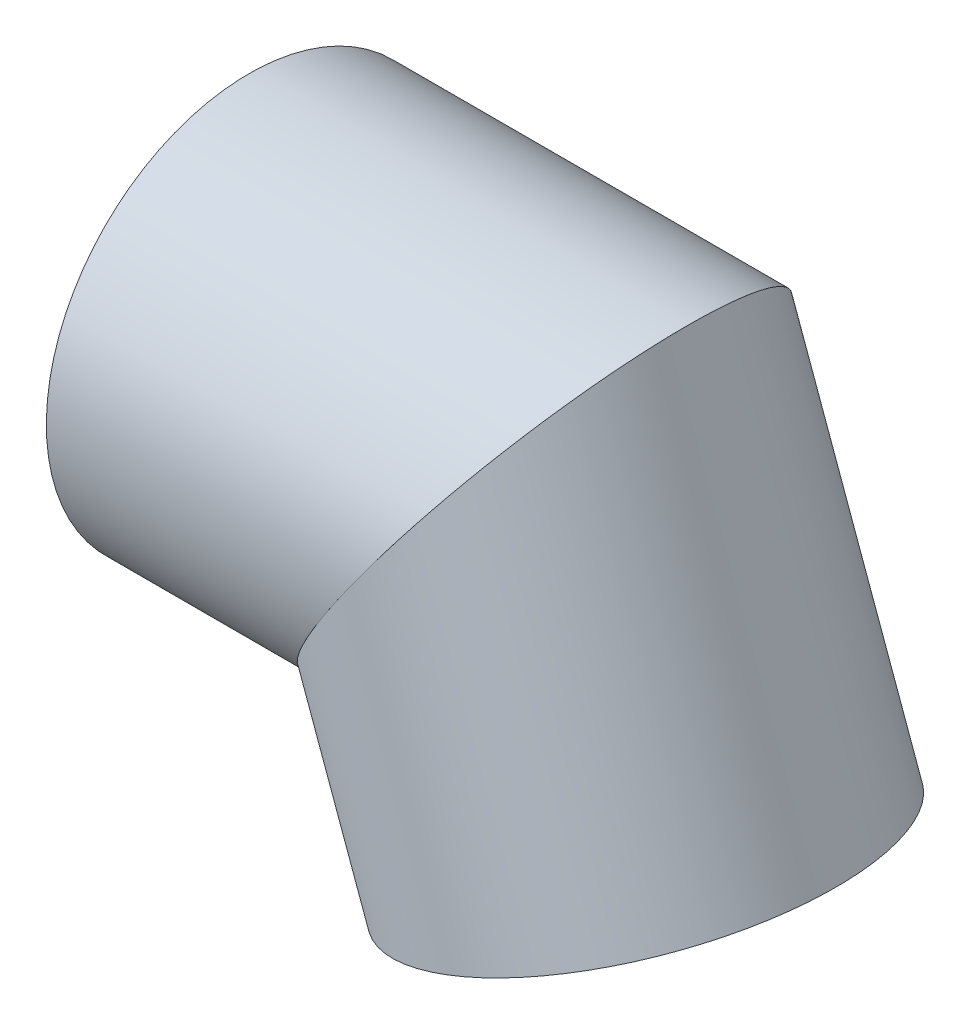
ISO-10303-21;
HEADER;
FILE_DESCRIPTION(('STEP AP214'),'2;1');
FILE_NAME('part.step','',(''),(''),'','','');
FILE_SCHEMA(('AUTOMOTIVE_DESIGN { 1 0 10303 214 1 1 1 1 }'));
ENDSEC;
DATA;
#1=APPLICATION_CONTEXT('core data for automotive mechanical design processes');
#2=APPLICATION_PROTOCOL_DEFINITION('international standard','automotive_design',2000,#1);
#3=PRODUCT_CONTEXT('',#1,'mechanical');
#4=PRODUCT('Part','Part','',(#3));
#5=PRODUCT_RELATED_PRODUCT_CATEGORY('part','',(#4));
#6=PRODUCT_DEFINITION_FORMATION('','',#4);
#7=PRODUCT_DEFINITION_CONTEXT('part definition',#1,'design');
#8=PRODUCT_DEFINITION('design','',#6,#7);
#9=PRODUCT_DEFINITION_SHAPE('','',#8);
#10=(LENGTH_UNIT() NAMED_UNIT(*) SI_UNIT(.MILLI.,.METRE.));
#11=(NAMED_UNIT(*) PLANE_ANGLE_UNIT() SI_UNIT($,.RADIAN.));
#12=(NAMED_UNIT(*) SI_UNIT($,.STERADIAN.) SOLID_ANGLE_UNIT());
#13=UNCERTAINTY_MEASURE_WITH_UNIT(LENGTH_MEASURE(1.E-05),#10,'distance_accuracy_value','');
#14=(GEOMETRIC_REPRESENTATION_CONTEXT(3) GLOBAL_UNCERTAINTY_ASSIGNED_CONTEXT((#13)) GLOBAL_UNIT_ASSIGNED_CONTEXT((#10,
#11,#12)) REPRESENTATION_CONTEXT('',''));
#15=CARTESIAN_POINT('',(0.,0.,0.));
#16=DIRECTION('',(0.,0.,1.));
#17=DIRECTION('',(1.,0.,0.));
#18=AXIS2_PLACEMENT_3D('',#15,#16,#17);
#19=CARTESIAN_POINT('',(0.,0.,2450.05584265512));
#20=DIRECTION('',(-0.819152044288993,0.573576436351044,0.));
#21=DIRECTION('',(-0.573576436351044,-0.819152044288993,0.));
#22=AXIS2_PLACEMENT_3D('',#19,#20,#21);
#23=PLANE('',#22);
#24=DIRECTION('',(0.573576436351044,0.819152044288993,0.));
#25=VECTOR('',#24,1.);
#26=CARTESIAN_POINT('',(0.,0.,0.500000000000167));
#27=LINE('',#26,#25);
#28=CARTESIAN_POINT('',(273.081183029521,390.00034722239,0.500000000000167));
#29=VERTEX_POINT('',#28);
#30=CARTESIAN_POINT('',(273.781391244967,391.000348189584,0.5));
#31=VERTEX_POINT('',#30);
#32=EDGE_CURVE('E57',#29,#31,#27,.T.);
#33=ORIENTED_EDGE('',*,*,#32,.F.);
#34=CARTESIAN_POINT('',(525.15565365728,750.,0.));
#35=DIRECTION('',(-0.819152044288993,0.573576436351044,0.));
#36=DIRECTION('',(-0.573576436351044,-0.819152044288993,0.));
#37=AXIS2_PLACEMENT_3D('',#34,#35,#36);
#38=ELLIPSE('',#37,439.478851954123,360.);
#39=CARTESIAN_POINT('',(273.081183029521,390.00034722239,-0.500000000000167));
#40=VERTEX_POINT('',#39);
#41=EDGE_CURVE('E96',#40,#29,#38,.F.);
#42=ORIENTED_EDGE('',*,*,#41,.F.);
#43=DIRECTION('',(0.573576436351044,0.819152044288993,0.));
#44=VECTOR('',#43,1.);
#45=CARTESIAN_POINT('',(0.,0.,-0.500000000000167));
#46=LINE('',#45,#44);
#47=CARTESIAN_POINT('',(273.781391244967,391.000348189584,-0.5));
#48=VERTEX_POINT('',#47);
#49=EDGE_CURVE('E108',#40,#48,#46,.T.);
#50=ORIENTED_EDGE('',*,*,#49,.T.);
#51=CARTESIAN_POINT('',(525.15565365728,750.,0.));
#52=DIRECTION('',(-0.819152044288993,0.573576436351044,0.));
#53=DIRECTION('',(-0.573576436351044,-0.819152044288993,0.));
#54=AXIS2_PLACEMENT_3D('',#51,#52,#53);
#55=ELLIPSE('',#54,438.258077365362,359.);
#56=EDGE_CURVE('E97',#48,#31,#55,.F.);
#57=ORIENTED_EDGE('',*,*,#56,.T.);
#58=EDGE_LOOP('',(#33,#42,#50,#57));
#59=FACE_BOUND('',#58,.T.);
#60=ADVANCED_FACE('F42',(#59),#23,.T.);
#61=CARTESIAN_POINT('',(438.941023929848,986.872748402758,0.));
#62=DIRECTION('',(0.342020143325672,-0.939692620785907,0.));
#63=DIRECTION('',(0.939692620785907,0.342020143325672,0.));
#64=AXIS2_PLACEMENT_3D('',#61,#62,#63);
#65=CYLINDRICAL_SURFACE('',#64,360.);
#66=DIRECTION('',(0.342020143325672,-0.939692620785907,0.));
#67=VECTOR('',#66,1.);
#68=CARTESIAN_POINT('',(100.652006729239,863.745615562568,0.5));
#69=LINE('',#68,#67);
#70=CARTESIAN_POINT('',(366.480448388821,133.387974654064,0.5));
#71=VERTEX_POINT('',#70);
#72=EDGE_CURVE('E101',#71,#29,#69,.F.);
#73=ORIENTED_EDGE('',*,*,#72,.F.);
#74=CARTESIAN_POINT('',(704.76946558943,256.515107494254,0.));
#75=DIRECTION('',(0.342020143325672,-0.939692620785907,0.));
#76=DIRECTION('',(0.939692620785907,0.342020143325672,0.));
#77=AXIS2_PLACEMENT_3D('',#74,#75,#76);
#78=CIRCLE('',#77,360.);
#79=CARTESIAN_POINT('',(366.480448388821,133.387974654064,-0.5));
#80=VERTEX_POINT('',#79);
#81=EDGE_CURVE('E93',#80,#71,#78,.T.);
#82=ORIENTED_EDGE('',*,*,#81,.F.);
#83=DIRECTION('',(0.342020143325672,-0.939692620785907,0.));
#84=VECTOR('',#83,1.);
#85=CARTESIAN_POINT('',(100.652006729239,863.745615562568,-0.5));
#86=LINE('',#85,#84);
#87=EDGE_CURVE('E112',#80,#40,#86,.F.);
#88=ORIENTED_EDGE('',*,*,#87,.T.);
#89=ORIENTED_EDGE('',*,*,#41,.T.);
#90=EDGE_LOOP('',(#73,#82,#88,#89));
#91=FACE_BOUND('',#90,.T.);
#92=ADVANCED_FACE('F44',(#91),#65,.T.);
#93=CARTESIAN_POINT('',(704.76946558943,256.515107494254,0.));
#94=DIRECTION('',(0.342020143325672,-0.939692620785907,0.));
#95=DIRECTION('',(0.939692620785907,0.342020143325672,0.));
#96=AXIS2_PLACEMENT_3D('',#93,#94,#95);
#97=PLANE('',#96);
#98=DIRECTION('',(0.939692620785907,0.342020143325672,0.));
#99=VECTOR('',#98,1.);
#100=CARTESIAN_POINT('',(704.76946558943,256.515107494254,0.5));
#101=LINE('',#100,#99);
#102=CARTESIAN_POINT('',(367.420141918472,133.729995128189,0.5));
#103=VERTEX_POINT('',#102);
#104=EDGE_CURVE('E81',#103,#71,#101,.F.);
#105=ORIENTED_EDGE('',*,*,#104,.F.);
#106=CARTESIAN_POINT('',(704.76946558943,256.515107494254,0.));
#107=DIRECTION('',(0.342020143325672,-0.939692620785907,0.));
#108=DIRECTION('',(0.939692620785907,0.342020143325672,0.));
#109=AXIS2_PLACEMENT_3D('',#106,#107,#108);
#110=CIRCLE('',#109,359.);
#111=CARTESIAN_POINT('',(367.420141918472,133.729995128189,-0.5));
#112=VERTEX_POINT('',#111);
#113=EDGE_CURVE('E91',#112,#103,#110,.T.);
#114=ORIENTED_EDGE('',*,*,#113,.F.);
#115=DIRECTION('',(0.939692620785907,0.342020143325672,0.));
#116=VECTOR('',#115,1.);
#117=CARTESIAN_POINT('',(704.76946558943,256.515107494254,-0.5));
#118=LINE('',#117,#116);
#119=EDGE_CURVE('E64',#112,#80,#118,.F.);
#120=ORIENTED_EDGE('',*,*,#119,.T.);
#121=ORIENTED_EDGE('',*,*,#81,.T.);
#122=EDGE_LOOP('',(#105,#114,#120,#121));
#123=FACE_BOUND('',#122,.T.);
#124=ADVANCED_FACE('F90',(#123),#97,.T.);
#125=CARTESIAN_POINT('',(438.941023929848,986.872748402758,0.));
#126=DIRECTION('',(0.342020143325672,-0.939692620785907,0.));
#127=DIRECTION('',(0.939692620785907,0.342020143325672,0.));
#128=AXIS2_PLACEMENT_3D('',#125,#126,#127);
#129=CYLINDRICAL_SURFACE('',#128,359.);
#130=ORIENTED_EDGE('',*,*,#113,.T.);
#131=DIRECTION('',(0.342020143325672,-0.939692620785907,0.));
#132=VECTOR('',#131,1.);
#133=CARTESIAN_POINT('',(101.59170025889,864.087636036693,0.5));
#134=LINE('',#133,#132);
#135=EDGE_CURVE('E12',#103,#31,#134,.F.);
#136=ORIENTED_EDGE('',*,*,#135,.T.);
#137=ORIENTED_EDGE('',*,*,#56,.F.);
#138=DIRECTION('',(0.342020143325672,-0.939692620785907,0.));
#139=VECTOR('',#138,1.);
#140=CARTESIAN_POINT('',(101.59170025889,864.087636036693,-0.5));
#141=LINE('',#140,#139);
#142=EDGE_CURVE('E50',#112,#48,#141,.F.);
#143=ORIENTED_EDGE('',*,*,#142,.F.);
#144=EDGE_LOOP('',(#130,#136,#137,#143));
#145=FACE_BOUND('',#144,.T.);
#146=ADVANCED_FACE('F95',(#145),#129,.F.);
#147=CARTESIAN_POINT('',(438.941023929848,986.872748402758,-0.5));
#148=DIRECTION('',(0.,0.,1.));
#149=DIRECTION('',(1.,0.,0.));
#150=AXIS2_PLACEMENT_3D('',#147,#148,#149);
#151=PLANE('',#150);
#152=ORIENTED_EDGE('',*,*,#119,.F.);
#153=ORIENTED_EDGE('',*,*,#142,.T.);
#154=ORIENTED_EDGE('',*,*,#49,.F.);
#155=ORIENTED_EDGE('',*,*,#87,.F.);
#156=EDGE_LOOP('',(#152,#153,#154,#155));
#157=FACE_BOUND('',#156,.T.);
#158=ADVANCED_FACE('F107',(#157),#151,.T.);
#159=CARTESIAN_POINT('',(438.941023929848,986.872748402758,0.5));
#160=DIRECTION('',(0.,0.,1.));
#161=DIRECTION('',(1.,0.,0.));
#162=AXIS2_PLACEMENT_3D('',#159,#160,#161);
#163=PLANE('',#162);
#164=ORIENTED_EDGE('',*,*,#72,.T.);
#165=ORIENTED_EDGE('',*,*,#32,.T.);
#166=ORIENTED_EDGE('',*,*,#135,.F.);
#167=ORIENTED_EDGE('',*,*,#104,.T.);
#168=EDGE_LOOP('',(#164,#165,#166,#167));
#169=FACE_BOUND('',#168,.T.);
#170=ADVANCED_FACE('F80',(#169),#163,.F.);
#171=CLOSED_SHELL('',(#60,#92,#124,#146,#158,#170));
#172=MANIFOLD_SOLID_BREP('B2',#171);
#173=CARTESIAN_POINT('',(777.230367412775,750.,0.));
#174=DIRECTION('',(-1.,0.,0.));
#175=DIRECTION('',(0.,0.,1.));
#176=AXIS2_PLACEMENT_3D('',#173,#174,#175);
#177=CYLINDRICAL_SURFACE('',#176,360.);
#178=DIRECTION('',(-1.,0.,0.));
#179=VECTOR('',#178,1.);
#180=CARTESIAN_POINT('',(777.230367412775,390.00034722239,0.5));
#181=LINE('',#180,#179);
#182=CARTESIAN_POINT('',(273.08118302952,390.00034722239,0.500000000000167));
#183=VERTEX_POINT('',#182);
#184=CARTESIAN_POINT('',(0.,390.00034722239,0.5));
#185=VERTEX_POINT('',#184);
#186=EDGE_CURVE('E202',#183,#185,#181,.T.);
#187=ORIENTED_EDGE('',*,*,#186,.F.);
#188=CARTESIAN_POINT('',(525.15565365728,750.,0.));
#189=DIRECTION('',(0.819152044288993,-0.573576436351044,0.));
#190=DIRECTION('',(-0.573576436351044,-0.819152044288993,0.));
#191=AXIS2_PLACEMENT_3D('',#188,#189,#190);
#192=ELLIPSE('',#191,439.478851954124,360.);
#193=CARTESIAN_POINT('',(273.08118302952,390.00034722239,-0.500000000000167));
#194=VERTEX_POINT('',#193);
#195=EDGE_CURVE('E223',#194,#183,#192,.T.);
#196=ORIENTED_EDGE('',*,*,#195,.F.);
#197=DIRECTION('',(-1.,0.,0.));
#198=VECTOR('',#197,1.);
#199=CARTESIAN_POINT('',(777.230367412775,390.00034722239,-0.5));
#200=LINE('',#199,#198);
#201=CARTESIAN_POINT('',(0.,390.00034722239,-0.5));
#202=VERTEX_POINT('',#201);
#203=EDGE_CURVE('E222',#194,#202,#200,.T.);
#204=ORIENTED_EDGE('',*,*,#203,.T.);
#205=CARTESIAN_POINT('',(0.,750.,0.));
#206=DIRECTION('',(1.,0.,0.));
#207=DIRECTION('',(0.,0.,-1.));
#208=AXIS2_PLACEMENT_3D('',#205,#206,#207);
#209=CIRCLE('',#208,360.);
#210=EDGE_CURVE('E217',#202,#185,#209,.T.);
#211=ORIENTED_EDGE('',*,*,#210,.T.);
#212=EDGE_LOOP('',(#187,#196,#204,#211));
#213=FACE_BOUND('',#212,.T.);
#214=ADVANCED_FACE('F165',(#213),#177,.T.);
#215=CARTESIAN_POINT('',(0.,750.,0.));
#216=DIRECTION('',(1.,0.,0.));
#217=DIRECTION('',(0.,0.,-1.));
#218=AXIS2_PLACEMENT_3D('',#215,#216,#217);
#219=PLANE('',#218);
#220=DIRECTION('',(0.,-1.,0.));
#221=VECTOR('',#220,1.);
#222=CARTESIAN_POINT('',(0.,750.,0.5));
#223=LINE('',#222,#221);
#224=CARTESIAN_POINT('',(0.,391.000348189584,0.5));
#225=VERTEX_POINT('',#224);
#226=EDGE_CURVE('E187',#225,#185,#223,.T.);
#227=ORIENTED_EDGE('',*,*,#226,.T.);
#228=ORIENTED_EDGE('',*,*,#210,.F.);
#229=DIRECTION('',(0.,-1.,0.));
#230=VECTOR('',#229,1.);
#231=CARTESIAN_POINT('',(0.,750.,-0.5));
#232=LINE('',#231,#230);
#233=CARTESIAN_POINT('',(0.,391.000348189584,-0.5));
#234=VERTEX_POINT('',#233);
#235=EDGE_CURVE('E219',#234,#202,#232,.T.);
#236=ORIENTED_EDGE('',*,*,#235,.F.);
#237=CARTESIAN_POINT('',(0.,750.,0.));
#238=DIRECTION('',(1.,0.,0.));
#239=DIRECTION('',(0.,0.,-1.));
#240=AXIS2_PLACEMENT_3D('',#237,#238,#239);
#241=CIRCLE('',#240,359.);
#242=EDGE_CURVE('E210',#234,#225,#241,.T.);
#243=ORIENTED_EDGE('',*,*,#242,.T.);
#244=EDGE_LOOP('',(#227,#228,#236,#243));
#245=FACE_BOUND('',#244,.T.);
#246=ADVANCED_FACE('F215',(#245),#219,.F.);
#247=CARTESIAN_POINT('',(0.,0.,-2051.21391646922));
#248=DIRECTION('',(0.819152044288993,-0.573576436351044,0.));
#249=DIRECTION('',(0.573576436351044,0.819152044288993,0.));
#250=AXIS2_PLACEMENT_3D('',#247,#248,#249);
#251=PLANE('',#250);
#252=ORIENTED_EDGE('',*,*,#195,.T.);
#253=DIRECTION('',(0.573576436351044,0.819152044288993,0.));
#254=VECTOR('',#253,1.);
#255=CARTESIAN_POINT('',(0.,0.,0.500000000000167));
#256=LINE('',#255,#254);
#257=CARTESIAN_POINT('',(273.781391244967,391.000348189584,0.5));
#258=VERTEX_POINT('',#257);
#259=EDGE_CURVE('E205',#183,#258,#256,.T.);
#260=ORIENTED_EDGE('',*,*,#259,.T.);
#261=CARTESIAN_POINT('',(525.15565365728,750.,0.));
#262=DIRECTION('',(0.819152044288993,-0.573576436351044,0.));
#263=DIRECTION('',(-0.573576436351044,-0.819152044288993,0.));
#264=AXIS2_PLACEMENT_3D('',#261,#262,#263);
#265=ELLIPSE('',#264,438.258077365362,359.);
#266=CARTESIAN_POINT('',(273.781391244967,391.000348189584,-0.5));
#267=VERTEX_POINT('',#266);
#268=EDGE_CURVE('E224',#267,#258,#265,.T.);
#269=ORIENTED_EDGE('',*,*,#268,.F.);
#270=DIRECTION('',(0.573576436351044,0.819152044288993,0.));
#271=VECTOR('',#270,1.);
#272=CARTESIAN_POINT('',(0.,0.,-0.500000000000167));
#273=LINE('',#272,#271);
#274=EDGE_CURVE('E179',#194,#267,#273,.T.);
#275=ORIENTED_EDGE('',*,*,#274,.F.);
#276=EDGE_LOOP('',(#252,#260,#269,#275));
#277=FACE_BOUND('',#276,.T.);
#278=ADVANCED_FACE('F239',(#277),#251,.T.);
#279=CARTESIAN_POINT('',(777.230367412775,750.,0.));
#280=DIRECTION('',(-1.,0.,0.));
#281=DIRECTION('',(0.,0.,1.));
#282=AXIS2_PLACEMENT_3D('',#279,#280,#281);
#283=CYLINDRICAL_SURFACE('',#282,359.);
#284=ORIENTED_EDGE('',*,*,#268,.T.);
#285=DIRECTION('',(-1.,0.,0.));
#286=VECTOR('',#285,1.);
#287=CARTESIAN_POINT('',(777.230367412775,391.000348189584,0.5));
#288=LINE('',#287,#286);
#289=EDGE_CURVE('E40',#258,#225,#288,.T.);
#290=ORIENTED_EDGE('',*,*,#289,.T.);
#291=ORIENTED_EDGE('',*,*,#242,.F.);
#292=DIRECTION('',(-1.,0.,0.));
#293=VECTOR('',#292,1.);
#294=CARTESIAN_POINT('',(777.230367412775,391.000348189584,-0.5));
#295=LINE('',#294,#293);
#296=EDGE_CURVE('E172',#267,#234,#295,.T.);
#297=ORIENTED_EDGE('',*,*,#296,.F.);
#298=EDGE_LOOP('',(#284,#290,#291,#297));
#299=FACE_BOUND('',#298,.T.);
#300=ADVANCED_FACE('F233',(#299),#283,.F.);
#301=CARTESIAN_POINT('',(525.15565365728,750.,-0.5));
#302=DIRECTION('',(0.,0.,-1.));
#303=DIRECTION('',(-1.,0.,0.));
#304=AXIS2_PLACEMENT_3D('',#301,#302,#303);
#305=PLANE('',#304);
#306=ORIENTED_EDGE('',*,*,#274,.T.);
#307=ORIENTED_EDGE('',*,*,#296,.T.);
#308=ORIENTED_EDGE('',*,*,#235,.T.);
#309=ORIENTED_EDGE('',*,*,#203,.F.);
#310=EDGE_LOOP('',(#306,#307,#308,#309));
#311=FACE_BOUND('',#310,.T.);
#312=ADVANCED_FACE('F229',(#311),#305,.F.);
#313=CARTESIAN_POINT('',(525.15565365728,750.,0.5));
#314=DIRECTION('',(0.,0.,-1.));
#315=DIRECTION('',(-1.,0.,0.));
#316=AXIS2_PLACEMENT_3D('',#313,#314,#315);
#317=PLANE('',#316);
#318=ORIENTED_EDGE('',*,*,#186,.T.);
#319=ORIENTED_EDGE('',*,*,#226,.F.);
#320=ORIENTED_EDGE('',*,*,#289,.F.);
#321=ORIENTED_EDGE('',*,*,#259,.F.);
#322=EDGE_LOOP('',(#318,#319,#320,#321));
#323=FACE_BOUND('',#322,.T.);
#324=ADVANCED_FACE('F203',(#323),#317,.T.);
#325=CLOSED_SHELL('',(#214,#246,#278,#300,#312,#324));
#326=MANIFOLD_SOLID_BREP('B6',#325);
#327=ADVANCED_BREP_SHAPE_REPRESENTATION('',(#18,#172,#326),#14);
#328=SHAPE_DEFINITION_REPRESENTATION(#9,#327);
ENDSEC;
END-ISO-10303-21;
